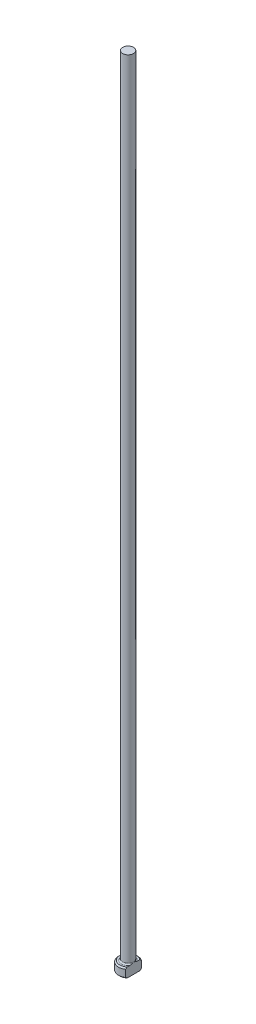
from build123d import *
from build123d.topology import SkipClean

# Parameters (mm, degrees)
CHAMFER1_SIZE = 0.2
FILLET1_R     = 0.2
KEY_DEPTH     = 126.017998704


with BuildPart() as part:
    # Sketch1 → Revolve1 (revolve)
    with BuildSketch(Plane.XY, mode=Mode.PRIVATE) as revolve1_sk:
        Polygon((0, 0), (-1.5, 0), (-1.5, 1.5), (-0.85, 1.5), (-0.85, 125), (0, 125), align=None)
    revolve(revolve1_sk.sketch.rotate(Axis((0, 259.958771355, 0), (0, -1, 0)), 270), axis=Axis((0, 259.958771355, 0), (0, -1, 0)))

    # Chamfer1
    chamfer1_edges = [part.edges().sort_by_distance(p)[0] for p in [
        (0, 1.5, -1.5),
        (0, 0, -1.5),
    ]]
    chamfer(chamfer1_edges, length=CHAMFER1_SIZE)

    # Fillet1
    fillet1_edges = [part.edges().sort_by_distance(p)[0] for p in [
        (0, 1.5, -0.85),
    ]]
    fillet(fillet1_edges, radius=FILLET1_R)

    # Sketch2 → KEY (cut, through all)
    with SkipClean():  # the faces are left unmerged after this step: merging them gives an invalid solid
        with BuildSketch(Plane(origin=(0, 0, 0), x_dir=(1, 0, 0), z_dir=(0, 1, 0))):
            with BuildLine():
                Line((0.85, 1.235920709), (0.85, -1.235920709))
                ThreePointArc((0.85, -1.235920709), (1.5, 0), (0.85, 1.235920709))
            make_face()
        extrude(amount=KEY_DEPTH, mode=Mode.SUBTRACT)


solid = part.part
